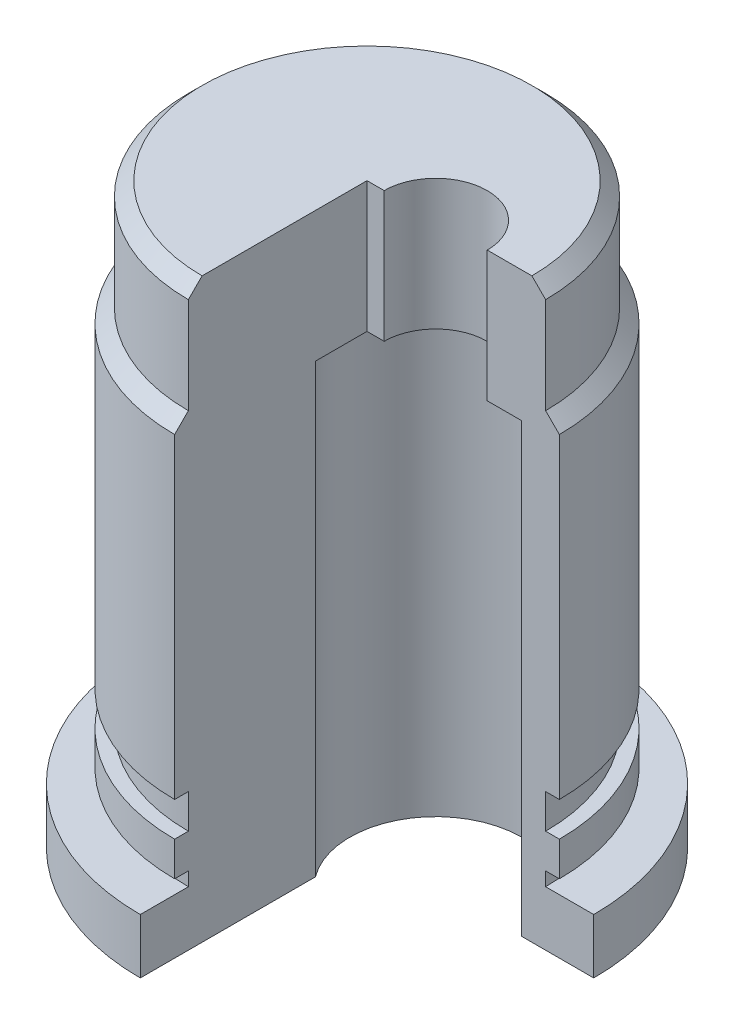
from build123d import *

# Parameters (mm, degrees)
ESQUISSE2_R             = 12.5
ENL_V_MAT_EXTRU_1_DEPTH = 65
ESQUISSE3_R             = 7.5
ENL_V_MAT_EXTRU_2_DEPTH = 81.018747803
ESQUISSE5_W             = 41.673563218
ESQUISSE5_H             = 34.947126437
ENL_V_MAT_EXTRU_4_DEPTH = 97.093704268


with BuildPart() as part:
    # Esquisse1 → R_volution1 (revolve)
    with BuildSketch(Plane.XY):
        Polygon((0, 84), (24, 84), (26, 82), (26, 68), (28, 66), (28, 20), (26, 20), (26, 15), (28, 15), (28, 10), (26, 10), (26, 8), (33, 8), (33, 0), (0, 0), align=None)
    revolve(axis=Axis((0, 0, 0), (0, 1, 0)))

    # Esquisse2 → Enl_v. mat.-Extru.1 (cut)
    with BuildSketch(Plane.XZ):
        with Locations((10, 0)):
            Circle(ESQUISSE2_R)
    extrude(amount=-ENL_V_MAT_EXTRU_1_DEPTH, mode=Mode.SUBTRACT)

    # Esquisse3 → Enl_v. mat.-Extru.2 (cut, through all)
    with BuildSketch(Plane.XZ.offset(-65)):
        with Locations((10, 0)):
            Circle(ESQUISSE3_R)
    extrude(amount=-ENL_V_MAT_EXTRU_2_DEPTH, mode=Mode.SUBTRACT)

    # Esquisse5 → Enl_v. mat.-Extru.4 (cut, through all)
    with BuildSketch(Plane(origin=(0, 84, 0), x_dir=(-1, 0, 0), z_dir=(0, 1, 0))):
        with Locations((-20.836781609, 17.473563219)):
            Rectangle(ESQUISSE5_W, ESQUISSE5_H)
    extrude(amount=-ENL_V_MAT_EXTRU_4_DEPTH, mode=Mode.SUBTRACT)


solid = part.part
